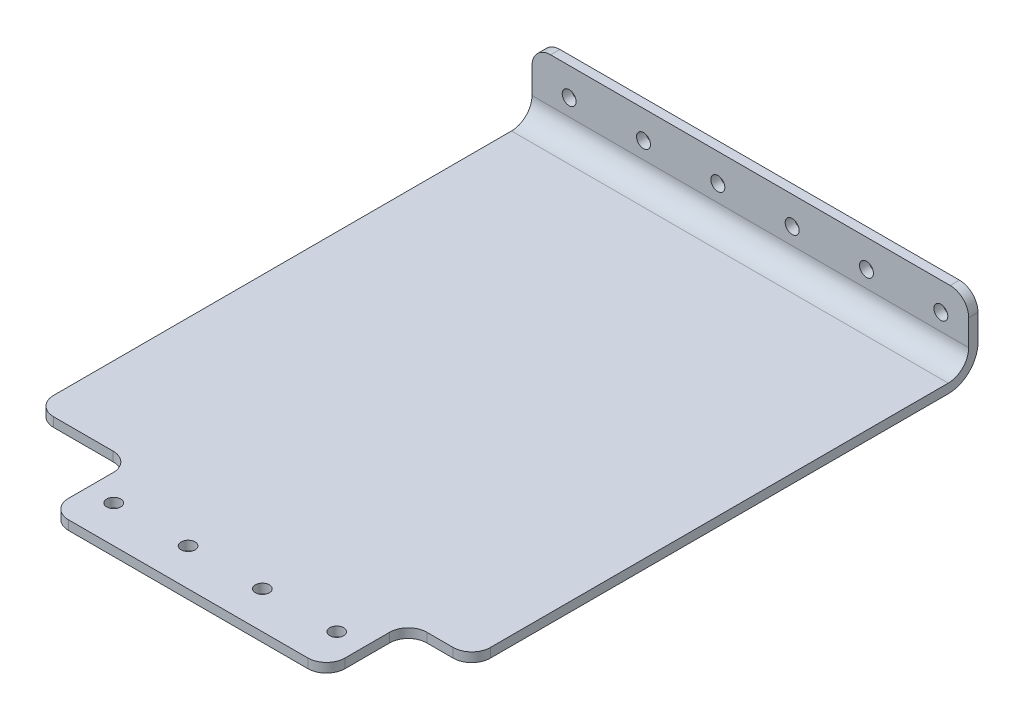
ISO-10303-21;
HEADER;
FILE_DESCRIPTION(('STEP AP214'),'2;1');
FILE_NAME('part.step','',(''),(''),'','','');
FILE_SCHEMA(('AUTOMOTIVE_DESIGN { 1 0 10303 214 1 1 1 1 }'));
ENDSEC;
DATA;
#1=APPLICATION_CONTEXT('core data for automotive mechanical design processes');
#2=APPLICATION_PROTOCOL_DEFINITION('international standard','automotive_design',2000,#1);
#3=PRODUCT_CONTEXT('',#1,'mechanical');
#4=PRODUCT('Part','Part','',(#3));
#5=PRODUCT_RELATED_PRODUCT_CATEGORY('part','',(#4));
#6=PRODUCT_DEFINITION_FORMATION('','',#4);
#7=PRODUCT_DEFINITION_CONTEXT('part definition',#1,'design');
#8=PRODUCT_DEFINITION('design','',#6,#7);
#9=PRODUCT_DEFINITION_SHAPE('','',#8);
#10=(LENGTH_UNIT() NAMED_UNIT(*) SI_UNIT(.MILLI.,.METRE.));
#11=(NAMED_UNIT(*) PLANE_ANGLE_UNIT() SI_UNIT($,.RADIAN.));
#12=(NAMED_UNIT(*) SI_UNIT($,.STERADIAN.) SOLID_ANGLE_UNIT());
#13=UNCERTAINTY_MEASURE_WITH_UNIT(LENGTH_MEASURE(1.E-05),#10,'distance_accuracy_value','');
#14=(GEOMETRIC_REPRESENTATION_CONTEXT(3) GLOBAL_UNCERTAINTY_ASSIGNED_CONTEXT((#13)) GLOBAL_UNIT_ASSIGNED_CONTEXT((#10,
#11,#12)) REPRESENTATION_CONTEXT('',''));
#15=CARTESIAN_POINT('',(0.,0.,0.));
#16=DIRECTION('',(0.,0.,1.));
#17=DIRECTION('',(1.,0.,0.));
#18=AXIS2_PLACEMENT_3D('',#15,#16,#17);
#19=CARTESIAN_POINT('',(-76.2,-3.175,-100.457));
#20=DIRECTION('',(-1.,0.,0.));
#21=DIRECTION('',(0.,0.,1.));
#22=AXIS2_PLACEMENT_3D('',#19,#20,#21);
#23=PLANE('',#22);
#24=DIRECTION('',(0.,0.,1.));
#25=VECTOR('',#24,1.);
#26=CARTESIAN_POINT('',(-76.2,-3.175,-100.457));
#27=LINE('',#26,#25);
#28=CARTESIAN_POINT('',(-76.2,-3.17500000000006,-90.2820000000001));
#29=VERTEX_POINT('',#28);
#30=CARTESIAN_POINT('',(-76.2,-3.175,66.167));
#31=VERTEX_POINT('',#30);
#32=EDGE_CURVE('E222',#29,#31,#27,.T.);
#33=ORIENTED_EDGE('',*,*,#32,.T.);
#34=DIRECTION('',(0.,1.,0.));
#35=VECTOR('',#34,1.);
#36=CARTESIAN_POINT('',(-76.2,0.,66.167));
#37=LINE('',#36,#35);
#38=CARTESIAN_POINT('',(-76.2,0.,66.167));
#39=VERTEX_POINT('',#38);
#40=EDGE_CURVE('E294',#31,#39,#37,.T.);
#41=ORIENTED_EDGE('',*,*,#40,.T.);
#42=DIRECTION('',(0.,0.,1.));
#43=VECTOR('',#42,1.);
#44=CARTESIAN_POINT('',(-76.2,0.,-100.457));
#45=LINE('',#44,#43);
#46=CARTESIAN_POINT('',(-76.2,0.,-90.2820000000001));
#47=VERTEX_POINT('',#46);
#48=EDGE_CURVE('E227',#47,#39,#45,.T.);
#49=ORIENTED_EDGE('',*,*,#48,.F.);
#50=DIRECTION('',(0.,-1.,0.));
#51=VECTOR('',#50,1.);
#52=CARTESIAN_POINT('',(-76.2,0.,-90.2820000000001));
#53=LINE('',#52,#51);
#54=EDGE_CURVE('E224',#47,#29,#53,.T.);
#55=ORIENTED_EDGE('',*,*,#54,.T.);
#56=EDGE_LOOP('',(#33,#41,#49,#55));
#57=FACE_BOUND('',#56,.T.);
#58=ADVANCED_FACE('F58',(#57),#23,.T.);
#59=CARTESIAN_POINT('',(0.,-3.175,0.));
#60=DIRECTION('',(0.,1.,0.));
#61=DIRECTION('',(0.,0.,1.));
#62=AXIS2_PLACEMENT_3D('',#59,#60,#61);
#63=PLANE('',#62);
#64=CARTESIAN_POINT('',(42.11828,-3.175,87.757));
#65=DIRECTION('',(0.,1.,0.));
#66=DIRECTION('',(0.,0.,1.));
#67=AXIS2_PLACEMENT_3D('',#64,#65,#66);
#68=CIRCLE('',#67,2.38125);
#69=CARTESIAN_POINT('',(42.11828,-3.175,90.13825));
#70=VERTEX_POINT('',#69);
#71=EDGE_CURVE('E586',#70,#70,#68,.F.);
#72=ORIENTED_EDGE('',*,*,#71,.F.);
#73=EDGE_LOOP('',(#72));
#74=FACE_BOUND('',#73,.T.);
#75=CARTESIAN_POINT('',(16.71828,-3.175,87.757));
#76=DIRECTION('',(0.,1.,0.));
#77=DIRECTION('',(0.,0.,1.));
#78=AXIS2_PLACEMENT_3D('',#75,#76,#77);
#79=CIRCLE('',#78,2.38125);
#80=CARTESIAN_POINT('',(16.71828,-3.175,90.13825));
#81=VERTEX_POINT('',#80);
#82=EDGE_CURVE('E582',#81,#81,#79,.F.);
#83=ORIENTED_EDGE('',*,*,#82,.F.);
#84=EDGE_LOOP('',(#83));
#85=FACE_BOUND('',#84,.T.);
#86=CARTESIAN_POINT('',(-8.68172000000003,-3.175,87.757));
#87=DIRECTION('',(0.,1.,0.));
#88=DIRECTION('',(0.,0.,1.));
#89=AXIS2_PLACEMENT_3D('',#86,#87,#88);
#90=CIRCLE('',#89,2.38125);
#91=CARTESIAN_POINT('',(-8.68172000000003,-3.175,90.13825));
#92=VERTEX_POINT('',#91);
#93=EDGE_CURVE('E574',#92,#92,#90,.F.);
#94=ORIENTED_EDGE('',*,*,#93,.F.);
#95=EDGE_LOOP('',(#94));
#96=FACE_BOUND('',#95,.T.);
#97=CARTESIAN_POINT('',(-34.08172,-3.175,87.757));
#98=DIRECTION('',(0.,1.,0.));
#99=DIRECTION('',(0.,0.,1.));
#100=AXIS2_PLACEMENT_3D('',#97,#98,#99);
#101=CIRCLE('',#100,2.38125);
#102=CARTESIAN_POINT('',(-34.08172,-3.175,90.13825));
#103=VERTEX_POINT('',#102);
#104=EDGE_CURVE('E207',#103,#103,#101,.F.);
#105=ORIENTED_EDGE('',*,*,#104,.F.);
#106=EDGE_LOOP('',(#105));
#107=FACE_BOUND('',#106,.T.);
#108=DIRECTION('',(0.,0.,1.));
#109=VECTOR('',#108,1.);
#110=CARTESIAN_POINT('',(73.025,-3.1750000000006,-100.457));
#111=LINE('',#110,#109);
#112=CARTESIAN_POINT('',(73.025,-3.17500000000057,-90.282));
#113=VERTEX_POINT('',#112);
#114=CARTESIAN_POINT('',(73.025,-3.17500000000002,66.167));
#115=VERTEX_POINT('',#114);
#116=EDGE_CURVE('E194',#113,#115,#111,.T.);
#117=ORIENTED_EDGE('',*,*,#116,.T.);
#118=CARTESIAN_POINT('',(66.6750000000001,-3.175,66.167));
#119=DIRECTION('',(0.,1.,0.));
#120=DIRECTION('',(0.,0.,1.));
#121=AXIS2_PLACEMENT_3D('',#118,#119,#120);
#122=CIRCLE('',#121,6.35);
#123=CARTESIAN_POINT('',(66.6750000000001,-3.175,72.517));
#124=VERTEX_POINT('',#123);
#125=EDGE_CURVE('E315',#115,#124,#122,.F.);
#126=ORIENTED_EDGE('',*,*,#125,.T.);
#127=DIRECTION('',(-1.,0.,0.));
#128=VECTOR('',#127,1.);
#129=CARTESIAN_POINT('',(76.2,-3.175,72.517));
#130=LINE('',#129,#128);
#131=CARTESIAN_POINT('',(57.658,-3.175,72.517));
#132=VERTEX_POINT('',#131);
#133=EDGE_CURVE('E318',#124,#132,#130,.T.);
#134=ORIENTED_EDGE('',*,*,#133,.T.);
#135=CARTESIAN_POINT('',(57.658,-3.175,78.867));
#136=DIRECTION('',(0.,1.,0.));
#137=DIRECTION('',(0.,0.,1.));
#138=AXIS2_PLACEMENT_3D('',#135,#136,#137);
#139=CIRCLE('',#138,6.35);
#140=CARTESIAN_POINT('',(51.308,-3.175,78.867));
#141=VERTEX_POINT('',#140);
#142=EDGE_CURVE('E300',#132,#141,#139,.T.);
#143=ORIENTED_EDGE('',*,*,#142,.T.);
#144=DIRECTION('',(0.,0.,1.));
#145=VECTOR('',#144,1.);
#146=CARTESIAN_POINT('',(51.308,-3.175,72.517));
#147=LINE('',#146,#145);
#148=CARTESIAN_POINT('',(51.308,-3.175,94.107));
#149=VERTEX_POINT('',#148);
#150=EDGE_CURVE('E326',#141,#149,#147,.T.);
#151=ORIENTED_EDGE('',*,*,#150,.T.);
#152=CARTESIAN_POINT('',(44.958,-3.175,94.107));
#153=DIRECTION('',(0.,1.,0.));
#154=DIRECTION('',(0.,0.,1.));
#155=AXIS2_PLACEMENT_3D('',#152,#153,#154);
#156=CIRCLE('',#155,6.35);
#157=CARTESIAN_POINT('',(44.958,-3.175,100.457));
#158=VERTEX_POINT('',#157);
#159=EDGE_CURVE('E282',#149,#158,#156,.F.);
#160=ORIENTED_EDGE('',*,*,#159,.T.);
#161=DIRECTION('',(1.,0.,0.));
#162=VECTOR('',#161,1.);
#163=CARTESIAN_POINT('',(-76.2,-3.175,100.457));
#164=LINE('',#163,#162);
#165=CARTESIAN_POINT('',(-36.83,-3.175,100.457));
#166=VERTEX_POINT('',#165);
#167=EDGE_CURVE('E242',#166,#158,#164,.T.);
#168=ORIENTED_EDGE('',*,*,#167,.F.);
#169=CARTESIAN_POINT('',(-36.83,-3.175,94.107));
#170=DIRECTION('',(0.,1.,0.));
#171=DIRECTION('',(0.,0.,1.));
#172=AXIS2_PLACEMENT_3D('',#169,#170,#171);
#173=CIRCLE('',#172,6.35);
#174=CARTESIAN_POINT('',(-43.18,-3.175,94.107));
#175=VERTEX_POINT('',#174);
#176=EDGE_CURVE('E280',#166,#175,#173,.F.);
#177=ORIENTED_EDGE('',*,*,#176,.T.);
#178=DIRECTION('',(0.,0.,-1.));
#179=VECTOR('',#178,1.);
#180=CARTESIAN_POINT('',(-43.18,-3.175,72.517));
#181=LINE('',#180,#179);
#182=CARTESIAN_POINT('',(-43.18,-3.175,78.867));
#183=VERTEX_POINT('',#182);
#184=EDGE_CURVE('E347',#175,#183,#181,.T.);
#185=ORIENTED_EDGE('',*,*,#184,.T.);
#186=CARTESIAN_POINT('',(-49.53,-3.175,78.867));
#187=DIRECTION('',(0.,1.,0.));
#188=DIRECTION('',(0.,0.,1.));
#189=AXIS2_PLACEMENT_3D('',#186,#187,#188);
#190=CIRCLE('',#189,6.35);
#191=CARTESIAN_POINT('',(-49.53,-3.175,72.517));
#192=VERTEX_POINT('',#191);
#193=EDGE_CURVE('E304',#183,#192,#190,.T.);
#194=ORIENTED_EDGE('',*,*,#193,.T.);
#195=DIRECTION('',(-1.,0.,0.));
#196=VECTOR('',#195,1.);
#197=CARTESIAN_POINT('',(-76.2,-3.175,72.517));
#198=LINE('',#197,#196);
#199=CARTESIAN_POINT('',(-69.85,-3.175,72.517));
#200=VERTEX_POINT('',#199);
#201=EDGE_CURVE('E350',#192,#200,#198,.T.);
#202=ORIENTED_EDGE('',*,*,#201,.T.);
#203=CARTESIAN_POINT('',(-69.85,-3.175,66.167));
#204=DIRECTION('',(0.,1.,0.));
#205=DIRECTION('',(0.,0.,1.));
#206=AXIS2_PLACEMENT_3D('',#203,#204,#205);
#207=CIRCLE('',#206,6.35);
#208=EDGE_CURVE('E278',#200,#31,#207,.F.);
#209=ORIENTED_EDGE('',*,*,#208,.T.);
#210=ORIENTED_EDGE('',*,*,#32,.F.);
#211=DIRECTION('',(-1.,0.,0.));
#212=VECTOR('',#211,1.);
#213=CARTESIAN_POINT('',(-76.2,-3.17500000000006,-90.2820000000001));
#214=LINE('',#213,#212);
#215=EDGE_CURVE('E213',#29,#113,#214,.F.);
#216=ORIENTED_EDGE('',*,*,#215,.T.);
#217=EDGE_LOOP('',(#117,#126,#134,#143,#151,#160,#168,#177,#185,#194,#202,#209,#210,#216));
#218=FACE_BOUND('',#217,.T.);
#219=ADVANCED_FACE('F220',(#74,#85,#96,#107,#218),#63,.F.);
#220=CARTESIAN_POINT('',(0.,0.,0.));
#221=DIRECTION('',(0.,1.,0.));
#222=DIRECTION('',(0.,0.,1.));
#223=AXIS2_PLACEMENT_3D('',#220,#221,#222);
#224=PLANE('',#223);
#225=CARTESIAN_POINT('',(42.11828,0.,87.757));
#226=DIRECTION('',(0.,1.,0.));
#227=DIRECTION('',(0.,0.,1.));
#228=AXIS2_PLACEMENT_3D('',#225,#226,#227);
#229=CIRCLE('',#228,2.38125);
#230=CARTESIAN_POINT('',(42.11828,0.,90.13825));
#231=VERTEX_POINT('',#230);
#232=EDGE_CURVE('E562',#231,#231,#229,.T.);
#233=ORIENTED_EDGE('',*,*,#232,.F.);
#234=EDGE_LOOP('',(#233));
#235=FACE_BOUND('',#234,.T.);
#236=CARTESIAN_POINT('',(16.71828,0.,87.757));
#237=DIRECTION('',(0.,1.,0.));
#238=DIRECTION('',(0.,0.,1.));
#239=AXIS2_PLACEMENT_3D('',#236,#237,#238);
#240=CIRCLE('',#239,2.38125);
#241=CARTESIAN_POINT('',(16.71828,0.,90.13825));
#242=VERTEX_POINT('',#241);
#243=EDGE_CURVE('E566',#242,#242,#240,.T.);
#244=ORIENTED_EDGE('',*,*,#243,.F.);
#245=EDGE_LOOP('',(#244));
#246=FACE_BOUND('',#245,.T.);
#247=CARTESIAN_POINT('',(-8.68172000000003,0.,87.757));
#248=DIRECTION('',(0.,1.,0.));
#249=DIRECTION('',(0.,0.,1.));
#250=AXIS2_PLACEMENT_3D('',#247,#248,#249);
#251=CIRCLE('',#250,2.38125);
#252=CARTESIAN_POINT('',(-8.68172000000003,0.,90.13825));
#253=VERTEX_POINT('',#252);
#254=EDGE_CURVE('E570',#253,#253,#251,.T.);
#255=ORIENTED_EDGE('',*,*,#254,.F.);
#256=EDGE_LOOP('',(#255));
#257=FACE_BOUND('',#256,.T.);
#258=CARTESIAN_POINT('',(-34.08172,0.,87.757));
#259=DIRECTION('',(0.,1.,0.));
#260=DIRECTION('',(0.,0.,1.));
#261=AXIS2_PLACEMENT_3D('',#258,#259,#260);
#262=CIRCLE('',#261,2.38125);
#263=CARTESIAN_POINT('',(-34.08172,0.,90.13825));
#264=VERTEX_POINT('',#263);
#265=EDGE_CURVE('E573',#264,#264,#262,.T.);
#266=ORIENTED_EDGE('',*,*,#265,.F.);
#267=EDGE_LOOP('',(#266));
#268=FACE_BOUND('',#267,.T.);
#269=DIRECTION('',(-1.,0.,0.));
#270=VECTOR('',#269,1.);
#271=CARTESIAN_POINT('',(76.2,0.,72.517));
#272=LINE('',#271,#270);
#273=CARTESIAN_POINT('',(66.6750000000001,0.,72.517));
#274=VERTEX_POINT('',#273);
#275=CARTESIAN_POINT('',(57.658,0.,72.517));
#276=VERTEX_POINT('',#275);
#277=EDGE_CURVE('E217',#274,#276,#272,.T.);
#278=ORIENTED_EDGE('',*,*,#277,.F.);
#279=CARTESIAN_POINT('',(66.6750000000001,0.,66.167));
#280=DIRECTION('',(0.,1.,0.));
#281=DIRECTION('',(0.,0.,1.));
#282=AXIS2_PLACEMENT_3D('',#279,#280,#281);
#283=CIRCLE('',#282,6.35);
#284=CARTESIAN_POINT('',(73.025,0.,66.167));
#285=VERTEX_POINT('',#284);
#286=EDGE_CURVE('E309',#274,#285,#283,.T.);
#287=ORIENTED_EDGE('',*,*,#286,.T.);
#288=DIRECTION('',(0.,0.,1.));
#289=VECTOR('',#288,1.);
#290=CARTESIAN_POINT('',(73.025,0.,0.));
#291=LINE('',#290,#289);
#292=CARTESIAN_POINT('',(73.025,0.,-90.2820000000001));
#293=VERTEX_POINT('',#292);
#294=EDGE_CURVE('E333',#293,#285,#291,.T.);
#295=ORIENTED_EDGE('',*,*,#294,.F.);
#296=DIRECTION('',(-1.,0.,0.));
#297=VECTOR('',#296,1.);
#298=CARTESIAN_POINT('',(-76.2,0.,-90.2820000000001));
#299=LINE('',#298,#297);
#300=EDGE_CURVE('E229',#47,#293,#299,.F.);
#301=ORIENTED_EDGE('',*,*,#300,.F.);
#302=ORIENTED_EDGE('',*,*,#48,.T.);
#303=CARTESIAN_POINT('',(-69.85,0.,66.167));
#304=DIRECTION('',(0.,1.,0.));
#305=DIRECTION('',(0.,0.,1.));
#306=AXIS2_PLACEMENT_3D('',#303,#304,#305);
#307=CIRCLE('',#306,6.35);
#308=CARTESIAN_POINT('',(-69.85,0.,72.517));
#309=VERTEX_POINT('',#308);
#310=EDGE_CURVE('E272',#39,#309,#307,.T.);
#311=ORIENTED_EDGE('',*,*,#310,.T.);
#312=DIRECTION('',(-1.,0.,0.));
#313=VECTOR('',#312,1.);
#314=CARTESIAN_POINT('',(-76.2,0.,72.517));
#315=LINE('',#314,#313);
#316=CARTESIAN_POINT('',(-49.53,0.,72.517));
#317=VERTEX_POINT('',#316);
#318=EDGE_CURVE('E351',#317,#309,#315,.T.);
#319=ORIENTED_EDGE('',*,*,#318,.F.);
#320=CARTESIAN_POINT('',(-49.53,0.,78.867));
#321=DIRECTION('',(0.,1.,0.));
#322=DIRECTION('',(0.,0.,1.));
#323=AXIS2_PLACEMENT_3D('',#320,#321,#322);
#324=CIRCLE('',#323,6.35);
#325=CARTESIAN_POINT('',(-43.18,0.,78.867));
#326=VERTEX_POINT('',#325);
#327=EDGE_CURVE('E302',#317,#326,#324,.F.);
#328=ORIENTED_EDGE('',*,*,#327,.T.);
#329=DIRECTION('',(0.,0.,-1.));
#330=VECTOR('',#329,1.);
#331=CARTESIAN_POINT('',(-43.18,0.,72.517));
#332=LINE('',#331,#330);
#333=CARTESIAN_POINT('',(-43.18,0.,94.107));
#334=VERTEX_POINT('',#333);
#335=EDGE_CURVE('E343',#334,#326,#332,.T.);
#336=ORIENTED_EDGE('',*,*,#335,.F.);
#337=CARTESIAN_POINT('',(-36.83,0.,94.107));
#338=DIRECTION('',(0.,1.,0.));
#339=DIRECTION('',(0.,0.,1.));
#340=AXIS2_PLACEMENT_3D('',#337,#338,#339);
#341=CIRCLE('',#340,6.35);
#342=CARTESIAN_POINT('',(-36.83,0.,100.457));
#343=VERTEX_POINT('',#342);
#344=EDGE_CURVE('E274',#334,#343,#341,.T.);
#345=ORIENTED_EDGE('',*,*,#344,.T.);
#346=DIRECTION('',(1.,0.,0.));
#347=VECTOR('',#346,1.);
#348=CARTESIAN_POINT('',(-76.2,0.,100.457));
#349=LINE('',#348,#347);
#350=CARTESIAN_POINT('',(44.958,0.,100.457));
#351=VERTEX_POINT('',#350);
#352=EDGE_CURVE('E243',#343,#351,#349,.T.);
#353=ORIENTED_EDGE('',*,*,#352,.T.);
#354=CARTESIAN_POINT('',(44.958,0.,94.107));
#355=DIRECTION('',(0.,1.,0.));
#356=DIRECTION('',(0.,0.,1.));
#357=AXIS2_PLACEMENT_3D('',#354,#355,#356);
#358=CIRCLE('',#357,6.35);
#359=CARTESIAN_POINT('',(51.308,0.,94.107));
#360=VERTEX_POINT('',#359);
#361=EDGE_CURVE('E276',#351,#360,#358,.T.);
#362=ORIENTED_EDGE('',*,*,#361,.T.);
#363=DIRECTION('',(0.,0.,1.));
#364=VECTOR('',#363,1.);
#365=CARTESIAN_POINT('',(51.308,0.,72.517));
#366=LINE('',#365,#364);
#367=CARTESIAN_POINT('',(51.308,0.,78.867));
#368=VERTEX_POINT('',#367);
#369=EDGE_CURVE('E327',#368,#360,#366,.T.);
#370=ORIENTED_EDGE('',*,*,#369,.F.);
#371=CARTESIAN_POINT('',(57.658,0.,78.867));
#372=DIRECTION('',(0.,1.,0.));
#373=DIRECTION('',(0.,0.,1.));
#374=AXIS2_PLACEMENT_3D('',#371,#372,#373);
#375=CIRCLE('',#374,6.35);
#376=EDGE_CURVE('E297',#368,#276,#375,.F.);
#377=ORIENTED_EDGE('',*,*,#376,.T.);
#378=EDGE_LOOP('',(#278,#287,#295,#301,#302,#311,#319,#328,#336,#345,#353,#362,#370,#377));
#379=FACE_BOUND('',#378,.T.);
#380=ADVANCED_FACE('F332',(#235,#246,#257,#268,#379),#224,.T.);
#381=CARTESIAN_POINT('',(-76.2,-3.175,100.457));
#382=DIRECTION('',(0.,0.,1.));
#383=DIRECTION('',(1.,0.,0.));
#384=AXIS2_PLACEMENT_3D('',#381,#382,#383);
#385=PLANE('',#384);
#386=ORIENTED_EDGE('',*,*,#167,.T.);
#387=DIRECTION('',(0.,1.,0.));
#388=VECTOR('',#387,1.);
#389=CARTESIAN_POINT('',(44.958,0.,100.457));
#390=LINE('',#389,#388);
#391=EDGE_CURVE('E269',#158,#351,#390,.T.);
#392=ORIENTED_EDGE('',*,*,#391,.T.);
#393=ORIENTED_EDGE('',*,*,#352,.F.);
#394=DIRECTION('',(0.,1.,0.));
#395=VECTOR('',#394,1.);
#396=CARTESIAN_POINT('',(-36.83,-3.175,100.457));
#397=LINE('',#396,#395);
#398=EDGE_CURVE('E267',#343,#166,#397,.F.);
#399=ORIENTED_EDGE('',*,*,#398,.T.);
#400=EDGE_LOOP('',(#386,#392,#393,#399));
#401=FACE_BOUND('',#400,.T.);
#402=ADVANCED_FACE('F449',(#401),#385,.T.);
#403=CARTESIAN_POINT('',(-76.2,6.99999999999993,-90.2820000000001));
#404=DIRECTION('',(1.,0.,0.));
#405=DIRECTION('',(0.,0.,-1.));
#406=AXIS2_PLACEMENT_3D('',#403,#404,#405);
#407=PLANE('',#406);
#408=CARTESIAN_POINT('',(-76.2,6.99999999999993,-90.2820000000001));
#409=DIRECTION('',(-1.,0.,0.));
#410=DIRECTION('',(0.,0.,1.));
#411=AXIS2_PLACEMENT_3D('',#408,#409,#410);
#412=CIRCLE('',#411,6.99999999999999);
#413=CARTESIAN_POINT('',(-76.2,6.9999999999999,-97.2820000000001));
#414=VERTEX_POINT('',#413);
#415=EDGE_CURVE('E237',#414,#47,#412,.T.);
#416=ORIENTED_EDGE('',*,*,#415,.F.);
#417=DIRECTION('',(0.,0.,1.));
#418=VECTOR('',#417,1.);
#419=CARTESIAN_POINT('',(-76.2,6.99999999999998,-97.282));
#420=LINE('',#419,#418);
#421=CARTESIAN_POINT('',(-76.2,7.,-100.457));
#422=VERTEX_POINT('',#421);
#423=EDGE_CURVE('E403',#414,#422,#420,.F.);
#424=ORIENTED_EDGE('',*,*,#423,.T.);
#425=CARTESIAN_POINT('',(-76.2,6.99999999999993,-90.2820000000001));
#426=DIRECTION('',(-1.,0.,0.));
#427=DIRECTION('',(0.,0.,1.));
#428=AXIS2_PLACEMENT_3D('',#425,#426,#427);
#429=CIRCLE('',#428,10.175);
#430=EDGE_CURVE('E225',#422,#29,#429,.T.);
#431=ORIENTED_EDGE('',*,*,#430,.T.);
#432=ORIENTED_EDGE('',*,*,#54,.F.);
#433=EDGE_LOOP('',(#416,#424,#431,#432));
#434=FACE_BOUND('',#433,.T.);
#435=ADVANCED_FACE('F413',(#434),#407,.F.);
#436=CARTESIAN_POINT('',(-76.2,6.99999999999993,-90.2820000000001));
#437=DIRECTION('',(-1.,0.,0.));
#438=DIRECTION('',(0.,0.,-1.));
#439=AXIS2_PLACEMENT_3D('',#436,#437,#438);
#440=CYLINDRICAL_SURFACE('',#439,10.175);
#441=CARTESIAN_POINT('',(73.025,6.99999999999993,-90.2820000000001));
#442=DIRECTION('',(-1.,0.,0.));
#443=DIRECTION('',(0.,0.,1.));
#444=AXIS2_PLACEMENT_3D('',#441,#442,#443);
#445=CIRCLE('',#444,10.175);
#446=CARTESIAN_POINT('',(73.025,7.,-100.457));
#447=VERTEX_POINT('',#446);
#448=EDGE_CURVE('E199',#113,#447,#445,.F.);
#449=ORIENTED_EDGE('',*,*,#448,.F.);
#450=ORIENTED_EDGE('',*,*,#215,.F.);
#451=ORIENTED_EDGE('',*,*,#430,.F.);
#452=DIRECTION('',(-1.,0.,0.));
#453=VECTOR('',#452,1.);
#454=CARTESIAN_POINT('',(76.2,7.,-100.457));
#455=LINE('',#454,#453);
#456=EDGE_CURVE('E216',#422,#447,#455,.F.);
#457=ORIENTED_EDGE('',*,*,#456,.T.);
#458=EDGE_LOOP('',(#449,#450,#451,#457));
#459=FACE_BOUND('',#458,.T.);
#460=ADVANCED_FACE('F212',(#459),#440,.T.);
#461=CARTESIAN_POINT('',(-76.2,6.99999999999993,-90.2820000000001));
#462=DIRECTION('',(-1.,0.,0.));
#463=DIRECTION('',(0.,0.,-1.));
#464=AXIS2_PLACEMENT_3D('',#461,#462,#463);
#465=CYLINDRICAL_SURFACE('',#464,6.99999999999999);
#466=ORIENTED_EDGE('',*,*,#300,.T.);
#467=CARTESIAN_POINT('',(73.025,6.99999999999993,-90.2820000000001));
#468=DIRECTION('',(-1.,0.,0.));
#469=DIRECTION('',(0.,0.,1.));
#470=AXIS2_PLACEMENT_3D('',#467,#468,#469);
#471=CIRCLE('',#470,6.99999999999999);
#472=CARTESIAN_POINT('',(73.025,6.99999999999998,-97.2820000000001));
#473=VERTEX_POINT('',#472);
#474=EDGE_CURVE('E335',#293,#473,#471,.F.);
#475=ORIENTED_EDGE('',*,*,#474,.T.);
#476=DIRECTION('',(-1.,0.,0.));
#477=VECTOR('',#476,1.);
#478=CARTESIAN_POINT('',(76.2,6.99999999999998,-97.2820000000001));
#479=LINE('',#478,#477);
#480=EDGE_CURVE('E232',#473,#414,#479,.T.);
#481=ORIENTED_EDGE('',*,*,#480,.T.);
#482=ORIENTED_EDGE('',*,*,#415,.T.);
#483=EDGE_LOOP('',(#466,#475,#481,#482));
#484=FACE_BOUND('',#483,.T.);
#485=ADVANCED_FACE('F410',(#484),#465,.F.);
#486=CARTESIAN_POINT('',(-76.1999999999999,22.225,-100.457));
#487=DIRECTION('',(1.,0.,0.));
#488=DIRECTION('',(0.,1.,0.));
#489=AXIS2_PLACEMENT_3D('',#486,#487,#488);
#490=PLANE('',#489);
#491=DIRECTION('',(0.,-1.,0.));
#492=VECTOR('',#491,1.);
#493=CARTESIAN_POINT('',(-76.1999999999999,22.225,-97.2820000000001));
#494=LINE('',#493,#492);
#495=CARTESIAN_POINT('',(-76.2,15.875,-97.2820000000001));
#496=VERTEX_POINT('',#495);
#497=EDGE_CURVE('E400',#414,#496,#494,.F.);
#498=ORIENTED_EDGE('',*,*,#497,.T.);
#499=DIRECTION('',(0.,0.,1.));
#500=VECTOR('',#499,1.);
#501=CARTESIAN_POINT('',(-76.2,15.875,-100.457));
#502=LINE('',#501,#500);
#503=CARTESIAN_POINT('',(-76.2,15.875,-100.457));
#504=VERTEX_POINT('',#503);
#505=EDGE_CURVE('E255',#496,#504,#502,.F.);
#506=ORIENTED_EDGE('',*,*,#505,.T.);
#507=DIRECTION('',(0.,1.,0.));
#508=VECTOR('',#507,1.);
#509=CARTESIAN_POINT('',(-76.2,-2.44708098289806E-13,-100.457));
#510=LINE('',#509,#508);
#511=EDGE_CURVE('E395',#422,#504,#510,.T.);
#512=ORIENTED_EDGE('',*,*,#511,.F.);
#513=ORIENTED_EDGE('',*,*,#423,.F.);
#514=EDGE_LOOP('',(#498,#506,#512,#513));
#515=FACE_BOUND('',#514,.T.);
#516=ADVANCED_FACE('F416',(#515),#490,.F.);
#517=CARTESIAN_POINT('',(0.,-3.87451058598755E-13,-100.457));
#518=DIRECTION('',(0.,0.,1.));
#519=DIRECTION('',(0.,-1.,0.));
#520=AXIS2_PLACEMENT_3D('',#517,#518,#519);
#521=PLANE('',#520);
#522=CARTESIAN_POINT('',(-63.5,12.699999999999,-100.457));
#523=DIRECTION('',(0.,0.,1.));
#524=DIRECTION('',(1.,0.,0.));
#525=AXIS2_PLACEMENT_3D('',#522,#523,#524);
#526=CIRCLE('',#525,2.38125000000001);
#527=CARTESIAN_POINT('',(-61.11875,12.699999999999,-100.457));
#528=VERTEX_POINT('',#527);
#529=EDGE_CURVE('E359',#528,#528,#526,.T.);
#530=ORIENTED_EDGE('',*,*,#529,.T.);
#531=EDGE_LOOP('',(#530));
#532=FACE_BOUND('',#531,.T.);
#533=CARTESIAN_POINT('',(-38.1,12.6999999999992,-100.457));
#534=DIRECTION('',(0.,0.,1.));
#535=DIRECTION('',(1.,0.,0.));
#536=AXIS2_PLACEMENT_3D('',#533,#534,#535);
#537=CIRCLE('',#536,2.38125000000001);
#538=CARTESIAN_POINT('',(-35.71875,12.6999999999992,-100.457));
#539=VERTEX_POINT('',#538);
#540=EDGE_CURVE('E365',#539,#539,#537,.T.);
#541=ORIENTED_EDGE('',*,*,#540,.T.);
#542=EDGE_LOOP('',(#541));
#543=FACE_BOUND('',#542,.T.);
#544=CARTESIAN_POINT('',(-12.7,12.6999999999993,-100.457));
#545=DIRECTION('',(0.,0.,1.));
#546=DIRECTION('',(1.,0.,0.));
#547=AXIS2_PLACEMENT_3D('',#544,#545,#546);
#548=CIRCLE('',#547,2.38125000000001);
#549=CARTESIAN_POINT('',(-10.31875,12.6999999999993,-100.457));
#550=VERTEX_POINT('',#549);
#551=EDGE_CURVE('E371',#550,#550,#548,.T.);
#552=ORIENTED_EDGE('',*,*,#551,.T.);
#553=EDGE_LOOP('',(#552));
#554=FACE_BOUND('',#553,.T.);
#555=CARTESIAN_POINT('',(12.7,12.6999999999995,-100.457));
#556=DIRECTION('',(0.,0.,1.));
#557=DIRECTION('',(1.,0.,0.));
#558=AXIS2_PLACEMENT_3D('',#555,#556,#557);
#559=CIRCLE('',#558,2.38125000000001);
#560=CARTESIAN_POINT('',(15.08125,12.6999999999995,-100.457));
#561=VERTEX_POINT('',#560);
#562=EDGE_CURVE('E377',#561,#561,#559,.T.);
#563=ORIENTED_EDGE('',*,*,#562,.T.);
#564=EDGE_LOOP('',(#563));
#565=FACE_BOUND('',#564,.T.);
#566=CARTESIAN_POINT('',(38.1,12.6999999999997,-100.457));
#567=DIRECTION('',(0.,0.,1.));
#568=DIRECTION('',(1.,0.,0.));
#569=AXIS2_PLACEMENT_3D('',#566,#567,#568);
#570=CIRCLE('',#569,2.38125000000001);
#571=CARTESIAN_POINT('',(40.48125,12.6999999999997,-100.457));
#572=VERTEX_POINT('',#571);
#573=EDGE_CURVE('E383',#572,#572,#570,.T.);
#574=ORIENTED_EDGE('',*,*,#573,.T.);
#575=EDGE_LOOP('',(#574));
#576=FACE_BOUND('',#575,.T.);
#577=CARTESIAN_POINT('',(63.5,12.6999999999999,-100.457));
#578=DIRECTION('',(0.,0.,1.));
#579=DIRECTION('',(1.,0.,0.));
#580=AXIS2_PLACEMENT_3D('',#577,#578,#579);
#581=CIRCLE('',#580,2.38125000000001);
#582=CARTESIAN_POINT('',(65.88125,12.6999999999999,-100.457));
#583=VERTEX_POINT('',#582);
#584=EDGE_CURVE('E389',#583,#583,#581,.T.);
#585=ORIENTED_EDGE('',*,*,#584,.T.);
#586=EDGE_LOOP('',(#585));
#587=FACE_BOUND('',#586,.T.);
#588=DIRECTION('',(1.,0.,0.));
#589=VECTOR('',#588,1.);
#590=CARTESIAN_POINT('',(0.,22.225,-100.457));
#591=LINE('',#590,#589);
#592=CARTESIAN_POINT('',(-69.8499999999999,22.225,-100.457));
#593=VERTEX_POINT('',#592);
#594=CARTESIAN_POINT('',(66.675,22.225,-100.457));
#595=VERTEX_POINT('',#594);
#596=EDGE_CURVE('E239',#593,#595,#591,.T.);
#597=ORIENTED_EDGE('',*,*,#596,.T.);
#598=CARTESIAN_POINT('',(66.675,15.875,-100.457));
#599=DIRECTION('',(0.,0.,1.));
#600=DIRECTION('',(0.,-1.,0.));
#601=AXIS2_PLACEMENT_3D('',#598,#599,#600);
#602=CIRCLE('',#601,6.35);
#603=CARTESIAN_POINT('',(73.025,15.875,-100.457));
#604=VERTEX_POINT('',#603);
#605=EDGE_CURVE('E13',#595,#604,#602,.F.);
#606=ORIENTED_EDGE('',*,*,#605,.T.);
#607=DIRECTION('',(0.,1.,0.));
#608=VECTOR('',#607,1.);
#609=CARTESIAN_POINT('',(73.025,-3.1750000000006,-100.457));
#610=LINE('',#609,#608);
#611=EDGE_CURVE('E206',#447,#604,#610,.T.);
#612=ORIENTED_EDGE('',*,*,#611,.F.);
#613=ORIENTED_EDGE('',*,*,#456,.F.);
#614=ORIENTED_EDGE('',*,*,#511,.T.);
#615=CARTESIAN_POINT('',(-69.8499999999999,15.875,-100.457));
#616=DIRECTION('',(0.,0.,1.));
#617=DIRECTION('',(0.,-1.,0.));
#618=AXIS2_PLACEMENT_3D('',#615,#616,#617);
#619=CIRCLE('',#618,6.35);
#620=EDGE_CURVE('E257',#504,#593,#619,.F.);
#621=ORIENTED_EDGE('',*,*,#620,.T.);
#622=EDGE_LOOP('',(#597,#606,#612,#613,#614,#621));
#623=FACE_BOUND('',#622,.T.);
#624=ADVANCED_FACE('F427',(#532,#543,#554,#565,#576,#587,#623),#521,.F.);
#625=CARTESIAN_POINT('',(0.,-3.76365605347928E-13,-97.282));
#626=DIRECTION('',(0.,0.,1.));
#627=DIRECTION('',(0.,-1.,0.));
#628=AXIS2_PLACEMENT_3D('',#625,#626,#627);
#629=PLANE('',#628);
#630=DIRECTION('',(0.,-1.,0.));
#631=VECTOR('',#630,1.);
#632=CARTESIAN_POINT('',(73.025,-3.76365605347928E-13,-97.282));
#633=LINE('',#632,#631);
#634=CARTESIAN_POINT('',(73.025,15.875,-97.2820000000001));
#635=VERTEX_POINT('',#634);
#636=EDGE_CURVE('E218',#635,#473,#633,.T.);
#637=ORIENTED_EDGE('',*,*,#636,.F.);
#638=CARTESIAN_POINT('',(66.675,15.875,-97.2820000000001));
#639=DIRECTION('',(0.,0.,1.));
#640=DIRECTION('',(0.,-1.,0.));
#641=AXIS2_PLACEMENT_3D('',#638,#639,#640);
#642=CIRCLE('',#641,6.35);
#643=CARTESIAN_POINT('',(66.675,22.225,-97.2820000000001));
#644=VERTEX_POINT('',#643);
#645=EDGE_CURVE('E80',#635,#644,#642,.T.);
#646=ORIENTED_EDGE('',*,*,#645,.T.);
#647=DIRECTION('',(-1.,0.,0.));
#648=VECTOR('',#647,1.);
#649=CARTESIAN_POINT('',(76.2,22.225,-97.2820000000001));
#650=LINE('',#649,#648);
#651=CARTESIAN_POINT('',(-69.8499999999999,22.225,-97.2820000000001));
#652=VERTEX_POINT('',#651);
#653=EDGE_CURVE('E398',#652,#644,#650,.F.);
#654=ORIENTED_EDGE('',*,*,#653,.F.);
#655=CARTESIAN_POINT('',(-69.8499999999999,15.875,-97.2820000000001));
#656=DIRECTION('',(0.,0.,1.));
#657=DIRECTION('',(0.,-1.,0.));
#658=AXIS2_PLACEMENT_3D('',#655,#656,#657);
#659=CIRCLE('',#658,6.35);
#660=EDGE_CURVE('E253',#652,#496,#659,.T.);
#661=ORIENTED_EDGE('',*,*,#660,.T.);
#662=ORIENTED_EDGE('',*,*,#497,.F.);
#663=ORIENTED_EDGE('',*,*,#480,.F.);
#664=EDGE_LOOP('',(#637,#646,#654,#661,#662,#663));
#665=FACE_BOUND('',#664,.T.);
#666=CARTESIAN_POINT('',(-63.5,12.699999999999,-97.282));
#667=DIRECTION('',(0.,0.,1.));
#668=DIRECTION('',(1.,0.,0.));
#669=AXIS2_PLACEMENT_3D('',#666,#667,#668);
#670=CIRCLE('',#669,2.38125000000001);
#671=CARTESIAN_POINT('',(-61.11875,12.699999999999,-97.282));
#672=VERTEX_POINT('',#671);
#673=EDGE_CURVE('E354',#672,#672,#670,.T.);
#674=ORIENTED_EDGE('',*,*,#673,.F.);
#675=EDGE_LOOP('',(#674));
#676=FACE_BOUND('',#675,.T.);
#677=CARTESIAN_POINT('',(-38.1,12.6999999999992,-97.282));
#678=DIRECTION('',(0.,0.,1.));
#679=DIRECTION('',(1.,0.,0.));
#680=AXIS2_PLACEMENT_3D('',#677,#678,#679);
#681=CIRCLE('',#680,2.38125000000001);
#682=CARTESIAN_POINT('',(-35.71875,12.6999999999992,-97.282));
#683=VERTEX_POINT('',#682);
#684=EDGE_CURVE('E362',#683,#683,#681,.T.);
#685=ORIENTED_EDGE('',*,*,#684,.F.);
#686=EDGE_LOOP('',(#685));
#687=FACE_BOUND('',#686,.T.);
#688=CARTESIAN_POINT('',(-12.7,12.6999999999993,-97.282));
#689=DIRECTION('',(0.,0.,1.));
#690=DIRECTION('',(1.,0.,0.));
#691=AXIS2_PLACEMENT_3D('',#688,#689,#690);
#692=CIRCLE('',#691,2.38125000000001);
#693=CARTESIAN_POINT('',(-10.31875,12.6999999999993,-97.282));
#694=VERTEX_POINT('',#693);
#695=EDGE_CURVE('E368',#694,#694,#692,.T.);
#696=ORIENTED_EDGE('',*,*,#695,.F.);
#697=EDGE_LOOP('',(#696));
#698=FACE_BOUND('',#697,.T.);
#699=CARTESIAN_POINT('',(12.7,12.6999999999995,-97.282));
#700=DIRECTION('',(0.,0.,1.));
#701=DIRECTION('',(1.,0.,0.));
#702=AXIS2_PLACEMENT_3D('',#699,#700,#701);
#703=CIRCLE('',#702,2.38125000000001);
#704=CARTESIAN_POINT('',(15.08125,12.6999999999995,-97.282));
#705=VERTEX_POINT('',#704);
#706=EDGE_CURVE('E374',#705,#705,#703,.T.);
#707=ORIENTED_EDGE('',*,*,#706,.F.);
#708=EDGE_LOOP('',(#707));
#709=FACE_BOUND('',#708,.T.);
#710=CARTESIAN_POINT('',(38.1,12.6999999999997,-97.282));
#711=DIRECTION('',(0.,0.,1.));
#712=DIRECTION('',(1.,0.,0.));
#713=AXIS2_PLACEMENT_3D('',#710,#711,#712);
#714=CIRCLE('',#713,2.38125000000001);
#715=CARTESIAN_POINT('',(40.48125,12.6999999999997,-97.282));
#716=VERTEX_POINT('',#715);
#717=EDGE_CURVE('E380',#716,#716,#714,.T.);
#718=ORIENTED_EDGE('',*,*,#717,.F.);
#719=EDGE_LOOP('',(#718));
#720=FACE_BOUND('',#719,.T.);
#721=CARTESIAN_POINT('',(63.5,12.6999999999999,-97.282));
#722=DIRECTION('',(0.,0.,1.));
#723=DIRECTION('',(1.,0.,0.));
#724=AXIS2_PLACEMENT_3D('',#721,#722,#723);
#725=CIRCLE('',#724,2.38125000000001);
#726=CARTESIAN_POINT('',(65.88125,12.6999999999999,-97.282));
#727=VERTEX_POINT('',#726);
#728=EDGE_CURVE('E386',#727,#727,#725,.T.);
#729=ORIENTED_EDGE('',*,*,#728,.F.);
#730=EDGE_LOOP('',(#729));
#731=FACE_BOUND('',#730,.T.);
#732=ADVANCED_FACE('F418',(#665,#676,#687,#698,#709,#720,#731),#629,.T.);
#733=CARTESIAN_POINT('',(76.2,22.225,-100.457));
#734=DIRECTION('',(0.,-1.,0.));
#735=DIRECTION('',(0.,0.,-1.));
#736=AXIS2_PLACEMENT_3D('',#733,#734,#735);
#737=PLANE('',#736);
#738=ORIENTED_EDGE('',*,*,#653,.T.);
#739=DIRECTION('',(0.,0.,1.));
#740=VECTOR('',#739,1.);
#741=CARTESIAN_POINT('',(66.675,22.225,-100.457));
#742=LINE('',#741,#740);
#743=EDGE_CURVE('E66',#644,#595,#742,.F.);
#744=ORIENTED_EDGE('',*,*,#743,.T.);
#745=ORIENTED_EDGE('',*,*,#596,.F.);
#746=DIRECTION('',(0.,0.,1.));
#747=VECTOR('',#746,1.);
#748=CARTESIAN_POINT('',(-69.8499999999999,22.225,-100.457));
#749=LINE('',#748,#747);
#750=EDGE_CURVE('E246',#593,#652,#749,.T.);
#751=ORIENTED_EDGE('',*,*,#750,.T.);
#752=EDGE_LOOP('',(#738,#744,#745,#751));
#753=FACE_BOUND('',#752,.T.);
#754=ADVANCED_FACE('F424',(#753),#737,.F.);
#755=CARTESIAN_POINT('',(63.5,12.6999999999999,-100.457));
#756=DIRECTION('',(0.,0.,1.));
#757=DIRECTION('',(1.,0.,0.));
#758=AXIS2_PLACEMENT_3D('',#755,#756,#757);
#759=CYLINDRICAL_SURFACE('',#758,2.38125000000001);
#760=ORIENTED_EDGE('',*,*,#584,.F.);
#761=EDGE_LOOP('',(#760));
#762=FACE_BOUND('',#761,.T.);
#763=ORIENTED_EDGE('',*,*,#728,.T.);
#764=EDGE_LOOP('',(#763));
#765=FACE_BOUND('',#764,.T.);
#766=ADVANCED_FACE('F535',(#762,#765),#759,.F.);
#767=CARTESIAN_POINT('',(38.1,12.6999999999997,-100.457));
#768=DIRECTION('',(0.,0.,1.));
#769=DIRECTION('',(1.,0.,0.));
#770=AXIS2_PLACEMENT_3D('',#767,#768,#769);
#771=CYLINDRICAL_SURFACE('',#770,2.38125000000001);
#772=ORIENTED_EDGE('',*,*,#573,.F.);
#773=EDGE_LOOP('',(#772));
#774=FACE_BOUND('',#773,.T.);
#775=ORIENTED_EDGE('',*,*,#717,.T.);
#776=EDGE_LOOP('',(#775));
#777=FACE_BOUND('',#776,.T.);
#778=ADVANCED_FACE('F531',(#774,#777),#771,.F.);
#779=CARTESIAN_POINT('',(12.7,12.6999999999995,-100.457));
#780=DIRECTION('',(0.,0.,1.));
#781=DIRECTION('',(1.,0.,0.));
#782=AXIS2_PLACEMENT_3D('',#779,#780,#781);
#783=CYLINDRICAL_SURFACE('',#782,2.38125000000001);
#784=ORIENTED_EDGE('',*,*,#562,.F.);
#785=EDGE_LOOP('',(#784));
#786=FACE_BOUND('',#785,.T.);
#787=ORIENTED_EDGE('',*,*,#706,.T.);
#788=EDGE_LOOP('',(#787));
#789=FACE_BOUND('',#788,.T.);
#790=ADVANCED_FACE('F527',(#786,#789),#783,.F.);
#791=CARTESIAN_POINT('',(-12.7,12.6999999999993,-100.457));
#792=DIRECTION('',(0.,0.,1.));
#793=DIRECTION('',(1.,0.,0.));
#794=AXIS2_PLACEMENT_3D('',#791,#792,#793);
#795=CYLINDRICAL_SURFACE('',#794,2.38125000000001);
#796=ORIENTED_EDGE('',*,*,#551,.F.);
#797=EDGE_LOOP('',(#796));
#798=FACE_BOUND('',#797,.T.);
#799=ORIENTED_EDGE('',*,*,#695,.T.);
#800=EDGE_LOOP('',(#799));
#801=FACE_BOUND('',#800,.T.);
#802=ADVANCED_FACE('F523',(#798,#801),#795,.F.);
#803=CARTESIAN_POINT('',(-38.1,12.6999999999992,-100.457));
#804=DIRECTION('',(0.,0.,1.));
#805=DIRECTION('',(1.,0.,0.));
#806=AXIS2_PLACEMENT_3D('',#803,#804,#805);
#807=CYLINDRICAL_SURFACE('',#806,2.38125000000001);
#808=ORIENTED_EDGE('',*,*,#540,.F.);
#809=EDGE_LOOP('',(#808));
#810=FACE_BOUND('',#809,.T.);
#811=ORIENTED_EDGE('',*,*,#684,.T.);
#812=EDGE_LOOP('',(#811));
#813=FACE_BOUND('',#812,.T.);
#814=ADVANCED_FACE('F519',(#810,#813),#807,.F.);
#815=CARTESIAN_POINT('',(-63.5,12.699999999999,-100.457));
#816=DIRECTION('',(0.,0.,1.));
#817=DIRECTION('',(1.,0.,0.));
#818=AXIS2_PLACEMENT_3D('',#815,#816,#817);
#819=CYLINDRICAL_SURFACE('',#818,2.38125000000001);
#820=ORIENTED_EDGE('',*,*,#529,.F.);
#821=EDGE_LOOP('',(#820));
#822=FACE_BOUND('',#821,.T.);
#823=ORIENTED_EDGE('',*,*,#673,.T.);
#824=EDGE_LOOP('',(#823));
#825=FACE_BOUND('',#824,.T.);
#826=ADVANCED_FACE('F515',(#822,#825),#819,.F.);
#827=CARTESIAN_POINT('',(-76.2,-3.175,72.517));
#828=DIRECTION('',(0.,0.,-1.));
#829=DIRECTION('',(-1.,0.,0.));
#830=AXIS2_PLACEMENT_3D('',#827,#828,#829);
#831=PLANE('',#830);
#832=ORIENTED_EDGE('',*,*,#201,.F.);
#833=DIRECTION('',(0.,1.,0.));
#834=VECTOR('',#833,1.);
#835=CARTESIAN_POINT('',(-49.53,0.,72.517));
#836=LINE('',#835,#834);
#837=EDGE_CURVE('E291',#192,#317,#836,.T.);
#838=ORIENTED_EDGE('',*,*,#837,.T.);
#839=ORIENTED_EDGE('',*,*,#318,.T.);
#840=DIRECTION('',(0.,1.,0.));
#841=VECTOR('',#840,1.);
#842=CARTESIAN_POINT('',(-69.85,-3.175,72.517));
#843=LINE('',#842,#841);
#844=EDGE_CURVE('E289',#309,#200,#843,.F.);
#845=ORIENTED_EDGE('',*,*,#844,.T.);
#846=EDGE_LOOP('',(#832,#838,#839,#845));
#847=FACE_BOUND('',#846,.T.);
#848=ADVANCED_FACE('F483',(#847),#831,.F.);
#849=CARTESIAN_POINT('',(-43.18,-3.175,72.517));
#850=DIRECTION('',(1.,0.,0.));
#851=DIRECTION('',(0.,0.,-1.));
#852=AXIS2_PLACEMENT_3D('',#849,#850,#851);
#853=PLANE('',#852);
#854=ORIENTED_EDGE('',*,*,#184,.F.);
#855=DIRECTION('',(0.,1.,0.));
#856=VECTOR('',#855,1.);
#857=CARTESIAN_POINT('',(-43.18,0.,94.107));
#858=LINE('',#857,#856);
#859=EDGE_CURVE('E286',#175,#334,#858,.T.);
#860=ORIENTED_EDGE('',*,*,#859,.T.);
#861=ORIENTED_EDGE('',*,*,#335,.T.);
#862=DIRECTION('',(0.,1.,0.));
#863=VECTOR('',#862,1.);
#864=CARTESIAN_POINT('',(-43.18,-3.175,78.867));
#865=LINE('',#864,#863);
#866=EDGE_CURVE('E284',#326,#183,#865,.F.);
#867=ORIENTED_EDGE('',*,*,#866,.T.);
#868=EDGE_LOOP('',(#854,#860,#861,#867));
#869=FACE_BOUND('',#868,.T.);
#870=ADVANCED_FACE('F490',(#869),#853,.F.);
#871=CARTESIAN_POINT('',(51.308,-3.175,72.517));
#872=DIRECTION('',(-1.,0.,0.));
#873=DIRECTION('',(0.,0.,1.));
#874=AXIS2_PLACEMENT_3D('',#871,#872,#873);
#875=PLANE('',#874);
#876=ORIENTED_EDGE('',*,*,#150,.F.);
#877=DIRECTION('',(0.,1.,0.));
#878=VECTOR('',#877,1.);
#879=CARTESIAN_POINT('',(51.308,0.,78.867));
#880=LINE('',#879,#878);
#881=EDGE_CURVE('E261',#141,#368,#880,.T.);
#882=ORIENTED_EDGE('',*,*,#881,.T.);
#883=ORIENTED_EDGE('',*,*,#369,.T.);
#884=DIRECTION('',(0.,1.,0.));
#885=VECTOR('',#884,1.);
#886=CARTESIAN_POINT('',(51.308,-3.175,94.107));
#887=LINE('',#886,#885);
#888=EDGE_CURVE('E259',#360,#149,#887,.F.);
#889=ORIENTED_EDGE('',*,*,#888,.T.);
#890=EDGE_LOOP('',(#876,#882,#883,#889));
#891=FACE_BOUND('',#890,.T.);
#892=ADVANCED_FACE('F503',(#891),#875,.F.);
#893=CARTESIAN_POINT('',(76.2,-3.175,72.517));
#894=DIRECTION('',(0.,0.,-1.));
#895=DIRECTION('',(-1.,0.,0.));
#896=AXIS2_PLACEMENT_3D('',#893,#894,#895);
#897=PLANE('',#896);
#898=ORIENTED_EDGE('',*,*,#133,.F.);
#899=DIRECTION('',(0.,1.,0.));
#900=VECTOR('',#899,1.);
#901=CARTESIAN_POINT('',(66.6750000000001,-3.175,72.517));
#902=LINE('',#901,#900);
#903=EDGE_CURVE('E306',#124,#274,#902,.T.);
#904=ORIENTED_EDGE('',*,*,#903,.T.);
#905=ORIENTED_EDGE('',*,*,#277,.T.);
#906=DIRECTION('',(0.,1.,0.));
#907=VECTOR('',#906,1.);
#908=CARTESIAN_POINT('',(57.658,-3.175,72.517));
#909=LINE('',#908,#907);
#910=EDGE_CURVE('E264',#276,#132,#909,.F.);
#911=ORIENTED_EDGE('',*,*,#910,.T.);
#912=EDGE_LOOP('',(#898,#904,#905,#911));
#913=FACE_BOUND('',#912,.T.);
#914=ADVANCED_FACE('F322',(#913),#897,.F.);
#915=CARTESIAN_POINT('',(-69.8499999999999,15.875,-100.457));
#916=DIRECTION('',(0.,0.,1.));
#917=DIRECTION('',(0.,-1.,0.));
#918=AXIS2_PLACEMENT_3D('',#915,#916,#917);
#919=CYLINDRICAL_SURFACE('',#918,6.35);
#920=ORIENTED_EDGE('',*,*,#620,.F.);
#921=ORIENTED_EDGE('',*,*,#505,.F.);
#922=ORIENTED_EDGE('',*,*,#660,.F.);
#923=ORIENTED_EDGE('',*,*,#750,.F.);
#924=EDGE_LOOP('',(#920,#921,#922,#923));
#925=FACE_BOUND('',#924,.T.);
#926=ADVANCED_FACE('F423',(#925),#919,.T.);
#927=CARTESIAN_POINT('',(57.658,-3.175,78.867));
#928=DIRECTION('',(0.,-1.,0.));
#929=DIRECTION('',(0.,0.,-1.));
#930=AXIS2_PLACEMENT_3D('',#927,#928,#929);
#931=CYLINDRICAL_SURFACE('',#930,6.35);
#932=ORIENTED_EDGE('',*,*,#142,.F.);
#933=ORIENTED_EDGE('',*,*,#910,.F.);
#934=ORIENTED_EDGE('',*,*,#376,.F.);
#935=ORIENTED_EDGE('',*,*,#881,.F.);
#936=EDGE_LOOP('',(#932,#933,#934,#935));
#937=FACE_BOUND('',#936,.T.);
#938=ADVANCED_FACE('F453',(#937),#931,.F.);
#939=CARTESIAN_POINT('',(44.958,-3.175,94.107));
#940=DIRECTION('',(0.,-1.,0.));
#941=DIRECTION('',(0.,0.,-1.));
#942=AXIS2_PLACEMENT_3D('',#939,#940,#941);
#943=CYLINDRICAL_SURFACE('',#942,6.35);
#944=ORIENTED_EDGE('',*,*,#159,.F.);
#945=ORIENTED_EDGE('',*,*,#888,.F.);
#946=ORIENTED_EDGE('',*,*,#361,.F.);
#947=ORIENTED_EDGE('',*,*,#391,.F.);
#948=EDGE_LOOP('',(#944,#945,#946,#947));
#949=FACE_BOUND('',#948,.T.);
#950=ADVANCED_FACE('F456',(#949),#943,.T.);
#951=CARTESIAN_POINT('',(-36.83,-3.175,94.107));
#952=DIRECTION('',(0.,-1.,0.));
#953=DIRECTION('',(0.,0.,-1.));
#954=AXIS2_PLACEMENT_3D('',#951,#952,#953);
#955=CYLINDRICAL_SURFACE('',#954,6.35);
#956=ORIENTED_EDGE('',*,*,#176,.F.);
#957=ORIENTED_EDGE('',*,*,#398,.F.);
#958=ORIENTED_EDGE('',*,*,#344,.F.);
#959=ORIENTED_EDGE('',*,*,#859,.F.);
#960=EDGE_LOOP('',(#956,#957,#958,#959));
#961=FACE_BOUND('',#960,.T.);
#962=ADVANCED_FACE('F460',(#961),#955,.T.);
#963=CARTESIAN_POINT('',(-49.53,-3.175,78.867));
#964=DIRECTION('',(0.,-1.,0.));
#965=DIRECTION('',(0.,0.,-1.));
#966=AXIS2_PLACEMENT_3D('',#963,#964,#965);
#967=CYLINDRICAL_SURFACE('',#966,6.35);
#968=ORIENTED_EDGE('',*,*,#193,.F.);
#969=ORIENTED_EDGE('',*,*,#866,.F.);
#970=ORIENTED_EDGE('',*,*,#327,.F.);
#971=ORIENTED_EDGE('',*,*,#837,.F.);
#972=EDGE_LOOP('',(#968,#969,#970,#971));
#973=FACE_BOUND('',#972,.T.);
#974=ADVANCED_FACE('F464',(#973),#967,.F.);
#975=CARTESIAN_POINT('',(-69.85,-3.175,66.167));
#976=DIRECTION('',(0.,-1.,0.));
#977=DIRECTION('',(0.,0.,-1.));
#978=AXIS2_PLACEMENT_3D('',#975,#976,#977);
#979=CYLINDRICAL_SURFACE('',#978,6.35);
#980=ORIENTED_EDGE('',*,*,#208,.F.);
#981=ORIENTED_EDGE('',*,*,#844,.F.);
#982=ORIENTED_EDGE('',*,*,#310,.F.);
#983=ORIENTED_EDGE('',*,*,#40,.F.);
#984=EDGE_LOOP('',(#980,#981,#982,#983));
#985=FACE_BOUND('',#984,.T.);
#986=ADVANCED_FACE('F468',(#985),#979,.T.);
#987=CARTESIAN_POINT('',(73.025,-3.1750000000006,-100.457));
#988=DIRECTION('',(-1.,0.,0.));
#989=DIRECTION('',(0.,0.,1.));
#990=AXIS2_PLACEMENT_3D('',#987,#988,#989);
#991=PLANE('',#990);
#992=ORIENTED_EDGE('',*,*,#294,.T.);
#993=DIRECTION('',(0.,1.,0.));
#994=VECTOR('',#993,1.);
#995=CARTESIAN_POINT('',(73.025,-3.1750000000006,66.167));
#996=LINE('',#995,#994);
#997=EDGE_CURVE('E202',#285,#115,#996,.F.);
#998=ORIENTED_EDGE('',*,*,#997,.T.);
#999=ORIENTED_EDGE('',*,*,#116,.F.);
#1000=ORIENTED_EDGE('',*,*,#448,.T.);
#1001=ORIENTED_EDGE('',*,*,#611,.T.);
#1002=DIRECTION('',(0.,0.,1.));
#1003=VECTOR('',#1002,1.);
#1004=CARTESIAN_POINT('',(73.025,15.875,-100.457));
#1005=LINE('',#1004,#1003);
#1006=EDGE_CURVE('E311',#604,#635,#1005,.T.);
#1007=ORIENTED_EDGE('',*,*,#1006,.T.);
#1008=ORIENTED_EDGE('',*,*,#636,.T.);
#1009=ORIENTED_EDGE('',*,*,#474,.F.);
#1010=EDGE_LOOP('',(#992,#998,#999,#1000,#1001,#1007,#1008,#1009));
#1011=FACE_BOUND('',#1010,.T.);
#1012=ADVANCED_FACE('F197',(#1011),#991,.F.);
#1013=CARTESIAN_POINT('',(66.6750000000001,-3.175,66.167));
#1014=DIRECTION('',(0.,1.,0.));
#1015=DIRECTION('',(-1.,0.,0.));
#1016=AXIS2_PLACEMENT_3D('',#1013,#1014,#1015);
#1017=CYLINDRICAL_SURFACE('',#1016,6.35);
#1018=ORIENTED_EDGE('',*,*,#125,.F.);
#1019=ORIENTED_EDGE('',*,*,#997,.F.);
#1020=ORIENTED_EDGE('',*,*,#286,.F.);
#1021=ORIENTED_EDGE('',*,*,#903,.F.);
#1022=EDGE_LOOP('',(#1018,#1019,#1020,#1021));
#1023=FACE_BOUND('',#1022,.T.);
#1024=ADVANCED_FACE('F329',(#1023),#1017,.T.);
#1025=CARTESIAN_POINT('',(66.675,15.875,-100.457));
#1026=DIRECTION('',(0.,0.,1.));
#1027=DIRECTION('',(0.,-1.,0.));
#1028=AXIS2_PLACEMENT_3D('',#1025,#1026,#1027);
#1029=CYLINDRICAL_SURFACE('',#1028,6.35);
#1030=ORIENTED_EDGE('',*,*,#605,.F.);
#1031=ORIENTED_EDGE('',*,*,#743,.F.);
#1032=ORIENTED_EDGE('',*,*,#645,.F.);
#1033=ORIENTED_EDGE('',*,*,#1006,.F.);
#1034=EDGE_LOOP('',(#1030,#1031,#1032,#1033));
#1035=FACE_BOUND('',#1034,.T.);
#1036=ADVANCED_FACE('F60',(#1035),#1029,.T.);
#1037=CARTESIAN_POINT('',(-34.08172,-3.17600000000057,87.757));
#1038=DIRECTION('',(0.,1.,0.));
#1039=DIRECTION('',(0.,0.,1.));
#1040=AXIS2_PLACEMENT_3D('',#1037,#1038,#1039);
#1041=CYLINDRICAL_SURFACE('',#1040,2.38125);
#1042=ORIENTED_EDGE('',*,*,#265,.T.);
#1043=EDGE_LOOP('',(#1042));
#1044=FACE_BOUND('',#1043,.T.);
#1045=ORIENTED_EDGE('',*,*,#104,.T.);
#1046=EDGE_LOOP('',(#1045));
#1047=FACE_BOUND('',#1046,.T.);
#1048=ADVANCED_FACE('F431',(#1044,#1047),#1041,.F.);
#1049=CARTESIAN_POINT('',(-8.68172000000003,-3.17600000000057,87.757));
#1050=DIRECTION('',(0.,1.,0.));
#1051=DIRECTION('',(0.,0.,1.));
#1052=AXIS2_PLACEMENT_3D('',#1049,#1050,#1051);
#1053=CYLINDRICAL_SURFACE('',#1052,2.38125);
#1054=ORIENTED_EDGE('',*,*,#254,.T.);
#1055=EDGE_LOOP('',(#1054));
#1056=FACE_BOUND('',#1055,.T.);
#1057=ORIENTED_EDGE('',*,*,#93,.T.);
#1058=EDGE_LOOP('',(#1057));
#1059=FACE_BOUND('',#1058,.T.);
#1060=ADVANCED_FACE('F436',(#1056,#1059),#1053,.F.);
#1061=CARTESIAN_POINT('',(16.71828,-3.17600000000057,87.757));
#1062=DIRECTION('',(0.,1.,0.));
#1063=DIRECTION('',(0.,0.,1.));
#1064=AXIS2_PLACEMENT_3D('',#1061,#1062,#1063);
#1065=CYLINDRICAL_SURFACE('',#1064,2.38125);
#1066=ORIENTED_EDGE('',*,*,#243,.T.);
#1067=EDGE_LOOP('',(#1066));
#1068=FACE_BOUND('',#1067,.T.);
#1069=ORIENTED_EDGE('',*,*,#82,.T.);
#1070=EDGE_LOOP('',(#1069));
#1071=FACE_BOUND('',#1070,.T.);
#1072=ADVANCED_FACE('F593',(#1068,#1071),#1065,.F.);
#1073=CARTESIAN_POINT('',(42.11828,-3.17600000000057,87.757));
#1074=DIRECTION('',(0.,1.,0.));
#1075=DIRECTION('',(0.,0.,1.));
#1076=AXIS2_PLACEMENT_3D('',#1073,#1074,#1075);
#1077=CYLINDRICAL_SURFACE('',#1076,2.38125);
#1078=ORIENTED_EDGE('',*,*,#232,.T.);
#1079=EDGE_LOOP('',(#1078));
#1080=FACE_BOUND('',#1079,.T.);
#1081=ORIENTED_EDGE('',*,*,#71,.T.);
#1082=EDGE_LOOP('',(#1081));
#1083=FACE_BOUND('',#1082,.T.);
#1084=ADVANCED_FACE('F590',(#1080,#1083),#1077,.F.);
#1085=CLOSED_SHELL('',(#58,#219,#380,#402,#435,#460,#485,#516,#624,#732,#754,#766,#778,#790,
#802,#814,#826,#848,#870,#892,#914,#926,#938,#950,#962,#974,#986,#1012,#1024,#1036,#1048,#1060,
#1072,#1084));
#1086=MANIFOLD_SOLID_BREP('B2',#1085);
#1087=ADVANCED_BREP_SHAPE_REPRESENTATION('',(#18,#1086),#14);
#1088=SHAPE_DEFINITION_REPRESENTATION(#9,#1087);
ENDSEC;
END-ISO-10303-21;
